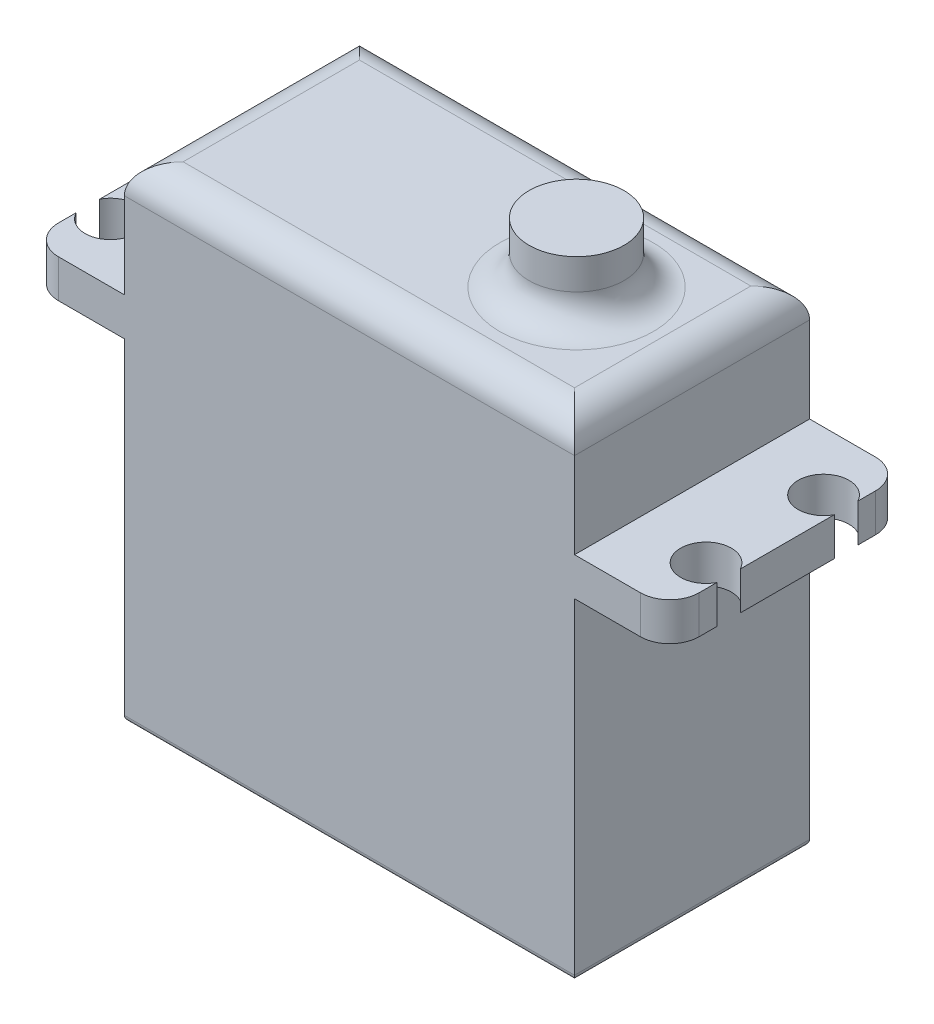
from build123d import *

# Parameters (mm, degrees)
BOSS_EXTRUDE2_DEPTH   = 3.24
BOSS_EXTRUDE2_2_DEPTH = 3.24
SKETCH1_9_W           = 38.3
SKETCH1_9_H           = 20
BOSS_EXTRUDE3_DEPTH   = 13.04
SKETCH2_R             = 4.04
BOSS_EXTRUDE4_DEPTH   = 5.1
SKETCH1_10_W          = 38.3
SKETCH1_10_H          = 20
BOSS_EXTRUDE7_DEPTH   = 16.74
SKETCH5_W             = 38.3
SKETCH5_H             = 20
BOSS_EXTRUDE8_DEPTH   = 11.5
FILLET1_R             = 2.5
FILLET2_R             = 0.5
SKETCH6_R             = 2.03
CUT_EXTRUDE1_DEPTH    = 1.66


with BuildPart() as part:
    # Sketch1 → Boss-Extrude2 (new body)
    with BuildSketch(Plane(origin=(0, 0, 0), x_dir=(1, 0, 0), z_dir=(0, 1, 0))):
        with BuildLine():
            Line((-19.15, -10), (-19.15, 10))
            Line((-19.15, 10), (-24.75, 10))
            ThreePointArc((-24.75, 10), (-26.517766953, 9.267766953), (-27.25, 7.5))
            Line((-27.25, 7.5), (-27.25, 6))
            ThreePointArc((-27.25, 6), (-23.175424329, 5), (-27.25, 4))
            Line((-27.25, 4), (-27.25, -4))
            ThreePointArc((-27.25, -4), (-23.175424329, -5), (-27.25, -6))
            Line((-27.25, -6), (-27.25, -7.5))
            ThreePointArc((-27.25, -7.5), (-26.517766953, -9.267766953), (-24.75, -10))
            Line((-24.75, -10), (-19.15, -10))
        make_face()
    extrude(amount=BOSS_EXTRUDE2_DEPTH)



with BuildPart() as body_2:
    # Sketch1 → Boss-Extrude2 2 (new body)
    with BuildSketch(Plane(origin=(0, 0, 0), x_dir=(1, 0, 0), z_dir=(0, 1, 0))):
        with BuildLine():
            Line((24.75, 10), (19.15, 10))
            Line((19.15, 10), (19.15, -10))
            Line((19.15, -10), (24.75, -10))
            ThreePointArc((24.75, -10), (26.517766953, -9.267766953), (27.25, -7.5))
            Line((27.25, -7.5), (27.25, -6))
            ThreePointArc((27.25, -6), (23.175424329, -5), (27.25, -4))
            Line((27.25, -4), (27.25, 4))
            ThreePointArc((27.25, 4), (23.175424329, 5), (27.25, 6))
            Line((27.25, 6), (27.25, 7.5))
            ThreePointArc((27.25, 7.5), (26.517766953, 9.267766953), (24.75, 10))
        make_face()
    extrude(amount=BOSS_EXTRUDE2_2_DEPTH)


with BuildPart() as part_1:
    add(part.part)

    add(body_2.part)  # Boss-Extrude3 merges body 2
    # Sketch1_9 → Boss-Extrude3 (add)
    with BuildSketch(Plane(origin=(0, 0, 0), x_dir=(1, 0, 0), z_dir=(0, 1, 0))):
        Rectangle(SKETCH1_9_W, SKETCH1_9_H)
    extrude(amount=BOSS_EXTRUDE3_DEPTH)

    # Sketch2 → Boss-Extrude4 (add)
    with BuildSketch(Plane(origin=(0, 13.04, 0), x_dir=(1, 0, 0), z_dir=(0, 1, 0))):
        with Locations(Location((9.32, 0, 0), (0, 0, 270))):
            Circle(SKETCH2_R)
    extrude(amount=BOSS_EXTRUDE4_DEPTH)

    # Sketch1_10 → Boss-Extrude7 (add)
    with BuildSketch(Plane(origin=(0, 0, 0), x_dir=(1, 0, 0), z_dir=(0, 1, 0))):
        Rectangle(SKETCH1_10_W, SKETCH1_10_H)
    extrude(amount=-BOSS_EXTRUDE7_DEPTH)

    # Sketch5 → Boss-Extrude8 (add)
    with BuildSketch(Plane.XZ.offset(16.74)):
        Rectangle(SKETCH5_W, SKETCH5_H)
    extrude(amount=BOSS_EXTRUDE8_DEPTH)

    # Fillet1
    fillet1_edges = [part_1.edges().sort_by_distance(p)[0] for p in [
        (19.15, 13.04, 0),
        (0, 13.04, -10),
        (-19.15, 13.04, 0),
        (0, 13.04, 10),
        (9.32, 13.04, -4.04),
    ]]
    fillet(fillet1_edges, radius=FILLET1_R)

    # Fillet2
    fillet2_edges = [part_1.edges().sort_by_distance(p)[0] for p in [
        (-19.15, -28.24, 0),
        (0, -28.24, -10),
        (19.15, -28.24, 0),
        (0, -28.24, 10),
    ]]
    fillet(fillet2_edges, radius=FILLET2_R)

    # Sketch6 → Cut-Extrude1 (cut)
    with BuildSketch(Plane.XZ.offset(28.24)):
        with Locations((-16.22, 7.07)):
            Circle(SKETCH6_R)
        with BuildLine():
            Line((-18.65, 9.5), (-18.65, 5.04))
            Line((-18.65, 5.04), (-16.22, 5.04))
            ThreePointArc((-16.22, 5.04), (-17.655426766, 8.505426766), (-14.19, 7.07))
            Line((-14.19, 7.07), (-14.19, 9.5))
            Line((-14.19, 9.5), (-18.65, 9.5))
        make_face()
        with Locations((-16.22, -7.07)):
            Circle(SKETCH6_R)
        with BuildLine():
            Line((-16.22, -5.04), (-18.65, -5.04))
            Line((-18.65, -5.04), (-18.65, -9.5))
            Line((-18.65, -9.5), (-14.19, -9.5))
            Line((-14.19, -9.5), (-14.19, -7.07))
            ThreePointArc((-14.19, -7.07), (-17.655426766, -8.505426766), (-16.22, -5.04))
        make_face()
        with Locations((16.22, 6.97)):
            Circle(SKETCH6_R)
        with BuildLine():
            Line((18.65, 9.5), (14.19, 9.5))
            Line((14.19, 9.5), (14.19, 6.97))
            ThreePointArc((14.19, 6.97), (16.22, 9), (18.25, 6.97))
            ThreePointArc((18.25, 6.97), (17.655426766, 5.534573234), (16.22, 4.94))
            Line((16.22, 4.94), (18.65, 4.94))
            Line((18.65, 4.94), (18.65, 9.5))
        make_face()
        with Locations((16.22, -7.07)):
            Circle(SKETCH6_R)
        with BuildLine():
            Line((14.19, -7.07), (14.19, -9.5))
            Line((14.19, -9.5), (18.65, -9.5))
            Line((18.65, -9.5), (18.65, -5.04))
            Line((18.65, -5.04), (16.22, -5.04))
            ThreePointArc((16.22, -5.04), (17.655426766, -5.634573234), (18.25, -7.07))
            ThreePointArc((18.25, -7.07), (16.22, -9.1), (14.19, -7.07))
        make_face()
    extrude(amount=-CUT_EXTRUDE1_DEPTH, mode=Mode.SUBTRACT)


solid = part_1.part
